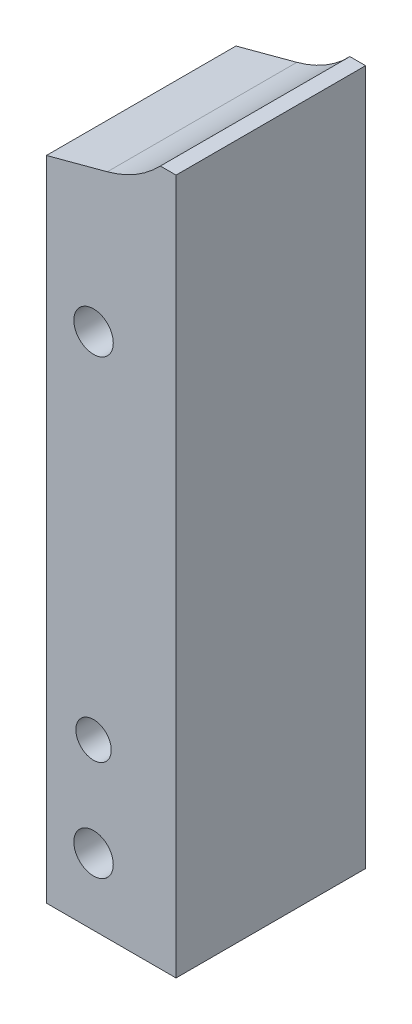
ISO-10303-21;
HEADER;
FILE_DESCRIPTION(('STEP AP214'),'2;1');
FILE_NAME('part.step','',(''),(''),'','','');
FILE_SCHEMA(('AUTOMOTIVE_DESIGN { 1 0 10303 214 1 1 1 1 }'));
ENDSEC;
DATA;
#1=APPLICATION_CONTEXT('core data for automotive mechanical design processes');
#2=APPLICATION_PROTOCOL_DEFINITION('international standard','automotive_design',2000,#1);
#3=PRODUCT_CONTEXT('',#1,'mechanical');
#4=PRODUCT('Part','Part','',(#3));
#5=PRODUCT_RELATED_PRODUCT_CATEGORY('part','',(#4));
#6=PRODUCT_DEFINITION_FORMATION('','',#4);
#7=PRODUCT_DEFINITION_CONTEXT('part definition',#1,'design');
#8=PRODUCT_DEFINITION('design','',#6,#7);
#9=PRODUCT_DEFINITION_SHAPE('','',#8);
#10=(LENGTH_UNIT() NAMED_UNIT(*) SI_UNIT(.MILLI.,.METRE.));
#11=(NAMED_UNIT(*) PLANE_ANGLE_UNIT() SI_UNIT($,.RADIAN.));
#12=(NAMED_UNIT(*) SI_UNIT($,.STERADIAN.) SOLID_ANGLE_UNIT());
#13=UNCERTAINTY_MEASURE_WITH_UNIT(LENGTH_MEASURE(1.E-05),#10,'distance_accuracy_value','');
#14=(GEOMETRIC_REPRESENTATION_CONTEXT(3) GLOBAL_UNCERTAINTY_ASSIGNED_CONTEXT((#13)) GLOBAL_UNIT_ASSIGNED_CONTEXT((#10,
#11,#12)) REPRESENTATION_CONTEXT('',''));
#15=CARTESIAN_POINT('',(0.,0.,0.));
#16=DIRECTION('',(0.,0.,1.));
#17=DIRECTION('',(1.,0.,0.));
#18=AXIS2_PLACEMENT_3D('',#15,#16,#17);
#19=CARTESIAN_POINT('',(25.,-20.,-24.125));
#20=DIRECTION('',(1.,0.,0.));
#21=DIRECTION('',(0.,1.,0.));
#22=AXIS2_PLACEMENT_3D('',#19,#20,#21);
#23=PLANE('',#22);
#24=DIRECTION('',(0.,0.,1.));
#25=VECTOR('',#24,1.);
#26=CARTESIAN_POINT('',(25.,-20.,-24.125));
#27=LINE('',#26,#25);
#28=CARTESIAN_POINT('',(25.,-20.,-24.125));
#29=VERTEX_POINT('',#28);
#30=CARTESIAN_POINT('',(25.,-20.,24.125));
#31=VERTEX_POINT('',#30);
#32=EDGE_CURVE('E351',#29,#31,#27,.T.);
#33=ORIENTED_EDGE('',*,*,#32,.T.);
#34=DIRECTION('',(0.,1.,0.));
#35=VECTOR('',#34,1.);
#36=CARTESIAN_POINT('',(25.,-20.,24.125));
#37=LINE('',#36,#35);
#38=CARTESIAN_POINT('',(25.,-197.,24.125));
#39=VERTEX_POINT('',#38);
#40=EDGE_CURVE('E400',#39,#31,#37,.T.);
#41=ORIENTED_EDGE('',*,*,#40,.F.);
#42=DIRECTION('',(0.,0.,1.));
#43=VECTOR('',#42,1.);
#44=CARTESIAN_POINT('',(25.,-197.,-24.125));
#45=LINE('',#44,#43);
#46=CARTESIAN_POINT('',(25.,-197.,-24.125));
#47=VERTEX_POINT('',#46);
#48=EDGE_CURVE('E11',#47,#39,#45,.T.);
#49=ORIENTED_EDGE('',*,*,#48,.F.);
#50=DIRECTION('',(0.,1.,0.));
#51=VECTOR('',#50,1.);
#52=CARTESIAN_POINT('',(25.,-20.,-24.125));
#53=LINE('',#52,#51);
#54=EDGE_CURVE('E401',#47,#29,#53,.T.);
#55=ORIENTED_EDGE('',*,*,#54,.T.);
#56=EDGE_LOOP('',(#33,#41,#49,#55));
#57=FACE_BOUND('',#56,.T.);
#58=ADVANCED_FACE('F348',(#57),#23,.T.);
#59=CARTESIAN_POINT('',(25.,-197.,-24.125));
#60=DIRECTION('',(0.,-1.,0.));
#61=DIRECTION('',(0.,0.,-1.));
#62=AXIS2_PLACEMENT_3D('',#59,#60,#61);
#63=PLANE('',#62);
#64=ORIENTED_EDGE('',*,*,#48,.T.);
#65=DIRECTION('',(1.,0.,0.));
#66=VECTOR('',#65,1.);
#67=CARTESIAN_POINT('',(25.,-197.,24.125));
#68=LINE('',#67,#66);
#69=CARTESIAN_POINT('',(-7.99999999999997,-197.,24.125));
#70=VERTEX_POINT('',#69);
#71=EDGE_CURVE('E419',#70,#39,#68,.T.);
#72=ORIENTED_EDGE('',*,*,#71,.F.);
#73=DIRECTION('',(0.,0.,1.));
#74=VECTOR('',#73,1.);
#75=CARTESIAN_POINT('',(-7.99999999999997,-197.,-24.125));
#76=LINE('',#75,#74);
#77=CARTESIAN_POINT('',(-7.99999999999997,-197.,-24.125));
#78=VERTEX_POINT('',#77);
#79=EDGE_CURVE('E356',#78,#70,#76,.T.);
#80=ORIENTED_EDGE('',*,*,#79,.F.);
#81=DIRECTION('',(1.,0.,0.));
#82=VECTOR('',#81,1.);
#83=CARTESIAN_POINT('',(25.,-197.,-24.125));
#84=LINE('',#83,#82);
#85=EDGE_CURVE('E406',#78,#47,#84,.T.);
#86=ORIENTED_EDGE('',*,*,#85,.T.);
#87=EDGE_LOOP('',(#64,#72,#80,#86));
#88=FACE_BOUND('',#87,.T.);
#89=ADVANCED_FACE('F473',(#88),#63,.T.);
#90=CARTESIAN_POINT('',(-7.99999999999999,-32.1666027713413,-24.125));
#91=DIRECTION('',(-1.,0.,0.));
#92=DIRECTION('',(0.,-1.,0.));
#93=AXIS2_PLACEMENT_3D('',#90,#91,#92);
#94=PLANE('',#93);
#95=ORIENTED_EDGE('',*,*,#79,.T.);
#96=DIRECTION('',(0.,-1.,0.));
#97=VECTOR('',#96,1.);
#98=CARTESIAN_POINT('',(-7.99999999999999,-32.1666027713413,24.125));
#99=LINE('',#98,#97);
#100=CARTESIAN_POINT('',(-7.99999999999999,-32.1666027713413,24.125));
#101=VERTEX_POINT('',#100);
#102=EDGE_CURVE('E431',#101,#70,#99,.T.);
#103=ORIENTED_EDGE('',*,*,#102,.F.);
#104=DIRECTION('',(0.,0.,1.));
#105=VECTOR('',#104,1.);
#106=CARTESIAN_POINT('',(-7.99999999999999,-32.1666027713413,-24.125));
#107=LINE('',#106,#105);
#108=CARTESIAN_POINT('',(-7.99999999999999,-32.1666027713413,-24.125));
#109=VERTEX_POINT('',#108);
#110=EDGE_CURVE('E456',#109,#101,#107,.T.);
#111=ORIENTED_EDGE('',*,*,#110,.F.);
#112=DIRECTION('',(0.,-1.,0.));
#113=VECTOR('',#112,1.);
#114=CARTESIAN_POINT('',(-7.99999999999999,-32.1666027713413,-24.125));
#115=LINE('',#114,#113);
#116=EDGE_CURVE('E452',#109,#78,#115,.T.);
#117=ORIENTED_EDGE('',*,*,#116,.T.);
#118=EDGE_LOOP('',(#95,#103,#111,#117));
#119=FACE_BOUND('',#118,.T.);
#120=ADVANCED_FACE('F469',(#119),#94,.T.);
#121=CARTESIAN_POINT('',(7.50575230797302,-28.011848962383,-24.125));
#122=DIRECTION('',(-0.258819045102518,0.965925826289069,0.));
#123=DIRECTION('',(-0.965925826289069,-0.258819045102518,0.));
#124=AXIS2_PLACEMENT_3D('',#121,#122,#123);
#125=PLANE('',#124);
#126=ORIENTED_EDGE('',*,*,#110,.T.);
#127=DIRECTION('',(-0.965925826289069,-0.258819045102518,0.));
#128=VECTOR('',#127,1.);
#129=CARTESIAN_POINT('',(7.50575230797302,-28.011848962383,24.125));
#130=LINE('',#129,#128);
#131=CARTESIAN_POINT('',(7.50575230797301,-28.011848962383,24.125));
#132=VERTEX_POINT('',#131);
#133=EDGE_CURVE('E428',#132,#101,#130,.T.);
#134=ORIENTED_EDGE('',*,*,#133,.F.);
#135=DIRECTION('',(0.,0.,1.));
#136=VECTOR('',#135,1.);
#137=CARTESIAN_POINT('',(7.50575230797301,-28.011848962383,-24.125));
#138=LINE('',#137,#136);
#139=CARTESIAN_POINT('',(7.50575230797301,-28.011848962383,-24.125));
#140=VERTEX_POINT('',#139);
#141=EDGE_CURVE('E458',#140,#132,#138,.T.);
#142=ORIENTED_EDGE('',*,*,#141,.F.);
#143=DIRECTION('',(-0.965925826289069,-0.258819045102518,0.));
#144=VECTOR('',#143,1.);
#145=CARTESIAN_POINT('',(7.50575230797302,-28.011848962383,-24.125));
#146=LINE('',#145,#144);
#147=EDGE_CURVE('E449',#140,#109,#146,.T.);
#148=ORIENTED_EDGE('',*,*,#147,.T.);
#149=EDGE_LOOP('',(#126,#134,#142,#148));
#150=FACE_BOUND('',#149,.T.);
#151=ADVANCED_FACE('F466',(#150),#125,.T.);
#152=CARTESIAN_POINT('',(0.,0.,-24.125));
#153=DIRECTION('',(0.,0.,1.));
#154=DIRECTION('',(1.,0.,0.));
#155=AXIS2_PLACEMENT_3D('',#152,#153,#154);
#156=CYLINDRICAL_SURFACE('',#155,29.);
#157=ORIENTED_EDGE('',*,*,#141,.T.);
#158=CARTESIAN_POINT('',(0.,0.,24.125));
#159=DIRECTION('',(0.,0.,-1.));
#160=DIRECTION('',(1.,0.,0.));
#161=AXIS2_PLACEMENT_3D('',#158,#159,#160);
#162=CIRCLE('',#161,29.);
#163=CARTESIAN_POINT('',(21.,-20.,24.125));
#164=VERTEX_POINT('',#163);
#165=EDGE_CURVE('E413',#164,#132,#162,.T.);
#166=ORIENTED_EDGE('',*,*,#165,.F.);
#167=DIRECTION('',(0.,0.,1.));
#168=VECTOR('',#167,1.);
#169=CARTESIAN_POINT('',(21.,-20.,-24.125));
#170=LINE('',#169,#168);
#171=CARTESIAN_POINT('',(21.,-20.,-24.125));
#172=VERTEX_POINT('',#171);
#173=EDGE_CURVE('E405',#172,#164,#170,.T.);
#174=ORIENTED_EDGE('',*,*,#173,.F.);
#175=CARTESIAN_POINT('',(0.,0.,-24.125));
#176=DIRECTION('',(0.,0.,-1.));
#177=DIRECTION('',(1.,0.,0.));
#178=AXIS2_PLACEMENT_3D('',#175,#176,#177);
#179=CIRCLE('',#178,29.);
#180=EDGE_CURVE('E446',#172,#140,#179,.T.);
#181=ORIENTED_EDGE('',*,*,#180,.T.);
#182=EDGE_LOOP('',(#157,#166,#174,#181));
#183=FACE_BOUND('',#182,.T.);
#184=ADVANCED_FACE('F460',(#183),#156,.F.);
#185=CARTESIAN_POINT('',(25.,-20.,-24.125));
#186=DIRECTION('',(0.,1.,0.));
#187=DIRECTION('',(0.,0.,1.));
#188=AXIS2_PLACEMENT_3D('',#185,#186,#187);
#189=PLANE('',#188);
#190=ORIENTED_EDGE('',*,*,#173,.T.);
#191=DIRECTION('',(-1.,0.,0.));
#192=VECTOR('',#191,1.);
#193=CARTESIAN_POINT('',(25.,-20.,24.125));
#194=LINE('',#193,#192);
#195=EDGE_CURVE('E408',#31,#164,#194,.T.);
#196=ORIENTED_EDGE('',*,*,#195,.F.);
#197=ORIENTED_EDGE('',*,*,#32,.F.);
#198=DIRECTION('',(-1.,0.,0.));
#199=VECTOR('',#198,1.);
#200=CARTESIAN_POINT('',(25.,-20.,-24.125));
#201=LINE('',#200,#199);
#202=EDGE_CURVE('E444',#29,#172,#201,.T.);
#203=ORIENTED_EDGE('',*,*,#202,.T.);
#204=EDGE_LOOP('',(#190,#196,#197,#203));
#205=FACE_BOUND('',#204,.T.);
#206=ADVANCED_FACE('F409',(#205),#189,.T.);
#207=CARTESIAN_POINT('',(0.,0.,-24.125));
#208=DIRECTION('',(0.,0.,1.));
#209=DIRECTION('',(1.,0.,0.));
#210=AXIS2_PLACEMENT_3D('',#207,#208,#209);
#211=PLANE('',#210);
#212=CARTESIAN_POINT('',(3.99999999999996,-65.0000000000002,-24.125));
#213=DIRECTION('',(0.,0.,1.));
#214=DIRECTION('',(1.,0.,0.));
#215=AXIS2_PLACEMENT_3D('',#212,#213,#214);
#216=CIRCLE('',#215,5.02);
#217=CARTESIAN_POINT('',(9.01999999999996,-65.0000000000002,-24.125));
#218=VERTEX_POINT('',#217);
#219=EDGE_CURVE('E434',#218,#218,#216,.T.);
#220=ORIENTED_EDGE('',*,*,#219,.T.);
#221=EDGE_LOOP('',(#220));
#222=FACE_BOUND('',#221,.T.);
#223=CARTESIAN_POINT('',(3.99999999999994,-155.,-24.125));
#224=DIRECTION('',(0.,0.,1.));
#225=DIRECTION('',(1.,0.,0.));
#226=AXIS2_PLACEMENT_3D('',#223,#224,#225);
#227=CIRCLE('',#226,4.5);
#228=CARTESIAN_POINT('',(8.49999999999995,-155.,-24.125));
#229=VERTEX_POINT('',#228);
#230=EDGE_CURVE('E437',#229,#229,#227,.T.);
#231=ORIENTED_EDGE('',*,*,#230,.T.);
#232=EDGE_LOOP('',(#231));
#233=FACE_BOUND('',#232,.T.);
#234=CARTESIAN_POINT('',(3.99999999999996,-180.,-24.125));
#235=DIRECTION('',(0.,0.,1.));
#236=DIRECTION('',(1.,0.,0.));
#237=AXIS2_PLACEMENT_3D('',#234,#235,#236);
#238=CIRCLE('',#237,5.02);
#239=CARTESIAN_POINT('',(9.01999999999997,-180.,-24.125));
#240=VERTEX_POINT('',#239);
#241=EDGE_CURVE('E440',#240,#240,#238,.T.);
#242=ORIENTED_EDGE('',*,*,#241,.T.);
#243=EDGE_LOOP('',(#242));
#244=FACE_BOUND('',#243,.T.);
#245=ORIENTED_EDGE('',*,*,#54,.F.);
#246=ORIENTED_EDGE('',*,*,#85,.F.);
#247=ORIENTED_EDGE('',*,*,#116,.F.);
#248=ORIENTED_EDGE('',*,*,#147,.F.);
#249=ORIENTED_EDGE('',*,*,#180,.F.);
#250=ORIENTED_EDGE('',*,*,#202,.F.);
#251=EDGE_LOOP('',(#245,#246,#247,#248,#249,#250));
#252=FACE_BOUND('',#251,.T.);
#253=ADVANCED_FACE('F472',(#222,#233,#244,#252),#211,.F.);
#254=CARTESIAN_POINT('',(3.99999999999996,-180.,-24.125));
#255=DIRECTION('',(0.,0.,1.));
#256=DIRECTION('',(1.,0.,0.));
#257=AXIS2_PLACEMENT_3D('',#254,#255,#256);
#258=CYLINDRICAL_SURFACE('',#257,5.02);
#259=ORIENTED_EDGE('',*,*,#241,.F.);
#260=EDGE_LOOP('',(#259));
#261=FACE_BOUND('',#260,.T.);
#262=CARTESIAN_POINT('',(3.99999999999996,-180.,24.125));
#263=DIRECTION('',(0.,0.,1.));
#264=DIRECTION('',(1.,0.,0.));
#265=AXIS2_PLACEMENT_3D('',#262,#263,#264);
#266=CIRCLE('',#265,5.02);
#267=CARTESIAN_POINT('',(9.01999999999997,-180.,24.125));
#268=VERTEX_POINT('',#267);
#269=EDGE_CURVE('E420',#268,#268,#266,.T.);
#270=ORIENTED_EDGE('',*,*,#269,.T.);
#271=EDGE_LOOP('',(#270));
#272=FACE_BOUND('',#271,.T.);
#273=ADVANCED_FACE('F491',(#261,#272),#258,.F.);
#274=CARTESIAN_POINT('',(3.99999999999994,-155.,-24.125));
#275=DIRECTION('',(0.,0.,1.));
#276=DIRECTION('',(1.,0.,0.));
#277=AXIS2_PLACEMENT_3D('',#274,#275,#276);
#278=CYLINDRICAL_SURFACE('',#277,4.5);
#279=ORIENTED_EDGE('',*,*,#230,.F.);
#280=EDGE_LOOP('',(#279));
#281=FACE_BOUND('',#280,.T.);
#282=CARTESIAN_POINT('',(3.99999999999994,-155.,24.125));
#283=DIRECTION('',(0.,0.,1.));
#284=DIRECTION('',(1.,0.,0.));
#285=AXIS2_PLACEMENT_3D('',#282,#283,#284);
#286=CIRCLE('',#285,4.5);
#287=CARTESIAN_POINT('',(8.49999999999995,-155.,24.125));
#288=VERTEX_POINT('',#287);
#289=EDGE_CURVE('E423',#288,#288,#286,.T.);
#290=ORIENTED_EDGE('',*,*,#289,.T.);
#291=EDGE_LOOP('',(#290));
#292=FACE_BOUND('',#291,.T.);
#293=ADVANCED_FACE('F496',(#281,#292),#278,.F.);
#294=CARTESIAN_POINT('',(3.99999999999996,-65.0000000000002,-24.125));
#295=DIRECTION('',(0.,0.,1.));
#296=DIRECTION('',(1.,0.,0.));
#297=AXIS2_PLACEMENT_3D('',#294,#295,#296);
#298=CYLINDRICAL_SURFACE('',#297,5.02);
#299=ORIENTED_EDGE('',*,*,#219,.F.);
#300=EDGE_LOOP('',(#299));
#301=FACE_BOUND('',#300,.T.);
#302=CARTESIAN_POINT('',(3.99999999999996,-65.0000000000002,24.125));
#303=DIRECTION('',(0.,0.,1.));
#304=DIRECTION('',(1.,0.,0.));
#305=AXIS2_PLACEMENT_3D('',#302,#303,#304);
#306=CIRCLE('',#305,5.02);
#307=CARTESIAN_POINT('',(9.01999999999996,-65.0000000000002,24.125));
#308=VERTEX_POINT('',#307);
#309=EDGE_CURVE('E512',#308,#308,#306,.T.);
#310=ORIENTED_EDGE('',*,*,#309,.T.);
#311=EDGE_LOOP('',(#310));
#312=FACE_BOUND('',#311,.T.);
#313=ADVANCED_FACE('F507',(#301,#312),#298,.F.);
#314=CARTESIAN_POINT('',(0.,0.,24.125));
#315=DIRECTION('',(0.,0.,1.));
#316=DIRECTION('',(1.,0.,0.));
#317=AXIS2_PLACEMENT_3D('',#314,#315,#316);
#318=PLANE('',#317);
#319=ORIENTED_EDGE('',*,*,#289,.F.);
#320=EDGE_LOOP('',(#319));
#321=FACE_BOUND('',#320,.T.);
#322=ORIENTED_EDGE('',*,*,#40,.T.);
#323=ORIENTED_EDGE('',*,*,#195,.T.);
#324=ORIENTED_EDGE('',*,*,#165,.T.);
#325=ORIENTED_EDGE('',*,*,#133,.T.);
#326=ORIENTED_EDGE('',*,*,#102,.T.);
#327=ORIENTED_EDGE('',*,*,#71,.T.);
#328=EDGE_LOOP('',(#322,#323,#324,#325,#326,#327));
#329=FACE_BOUND('',#328,.T.);
#330=ORIENTED_EDGE('',*,*,#269,.F.);
#331=EDGE_LOOP('',(#330));
#332=FACE_BOUND('',#331,.T.);
#333=ORIENTED_EDGE('',*,*,#309,.F.);
#334=EDGE_LOOP('',(#333));
#335=FACE_BOUND('',#334,.T.);
#336=ADVANCED_FACE('F416',(#321,#329,#332,#335),#318,.T.);
#337=CLOSED_SHELL('',(#58,#89,#120,#151,#184,#206,#253,#273,#293,#313,#336));
#338=MANIFOLD_SOLID_BREP('B2',#337);
#339=ADVANCED_BREP_SHAPE_REPRESENTATION('',(#18,#338),#14);
#340=SHAPE_DEFINITION_REPRESENTATION(#9,#339);
ENDSEC;
END-ISO-10303-21;
